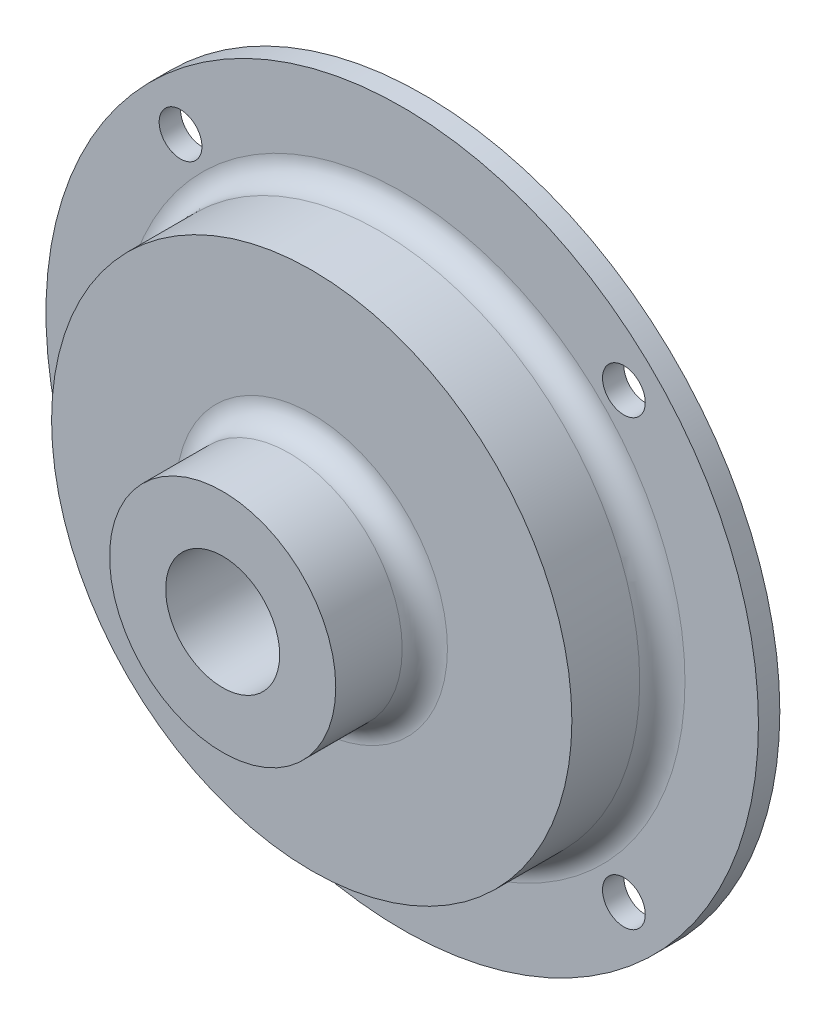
from build123d import *

# Parameters (mm, degrees)
SKETCH1_R           = 50
SKETCH1_R_2         = 3
BASE_EXTRUDE_DEPTH  = 3
SKETCH2_R           = 36.5125
BOSS_EXTRUDE1_DEPTH = 12.7
SKETCH3_R           = 15.875
BOSS_EXTRUDE2_DEPTH = 12.5
FILLET1_R           = 3.175
SKETCH4_R           = 8
CUT_EXTRUDE1_DEPTH  = 77.126473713


with BuildPart() as part:
    # Sketch1 → Base-Extrude (new body)
    with BuildSketch(Plane.XY):
        Circle(SKETCH1_R)
        with Locations((31.112698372, 31.112698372)):
            Circle(SKETCH1_R_2, mode=Mode.SUBTRACT)
        with Locations((-31.112698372, -31.112698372)):
            Circle(SKETCH1_R_2, mode=Mode.SUBTRACT)
        with Locations((31.112698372, -31.112698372)):
            Circle(SKETCH1_R_2, mode=Mode.SUBTRACT)
        with Locations((-31.112698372, 31.112698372)):
            Circle(SKETCH1_R_2, mode=Mode.SUBTRACT)
    extrude(amount=BASE_EXTRUDE_DEPTH)

    # Sketch2 → Boss-Extrude1 (add)
    with BuildSketch(Plane.XY.offset(3)):
        Circle(SKETCH2_R)
    extrude(amount=BOSS_EXTRUDE1_DEPTH)

    # Sketch3 → Boss-Extrude2 (add)
    with BuildSketch(Plane.XY.offset(15.7)):
        Circle(SKETCH3_R)
    extrude(amount=BOSS_EXTRUDE2_DEPTH)

    # Fillet1
    fillet1_edges = [part.edges().sort_by_distance(p)[0] for p in [
        (-36.5125, 0, 3),
        (-15.875, 0, 15.7),
    ]]
    fillet(fillet1_edges, radius=FILLET1_R)

    # Sketch4 → Cut-Extrude1 (cut, through all)
    with BuildSketch(Plane.XY.offset(28.2)):
        Circle(SKETCH4_R)
    extrude(amount=-CUT_EXTRUDE1_DEPTH, mode=Mode.SUBTRACT)


solid = part.part
